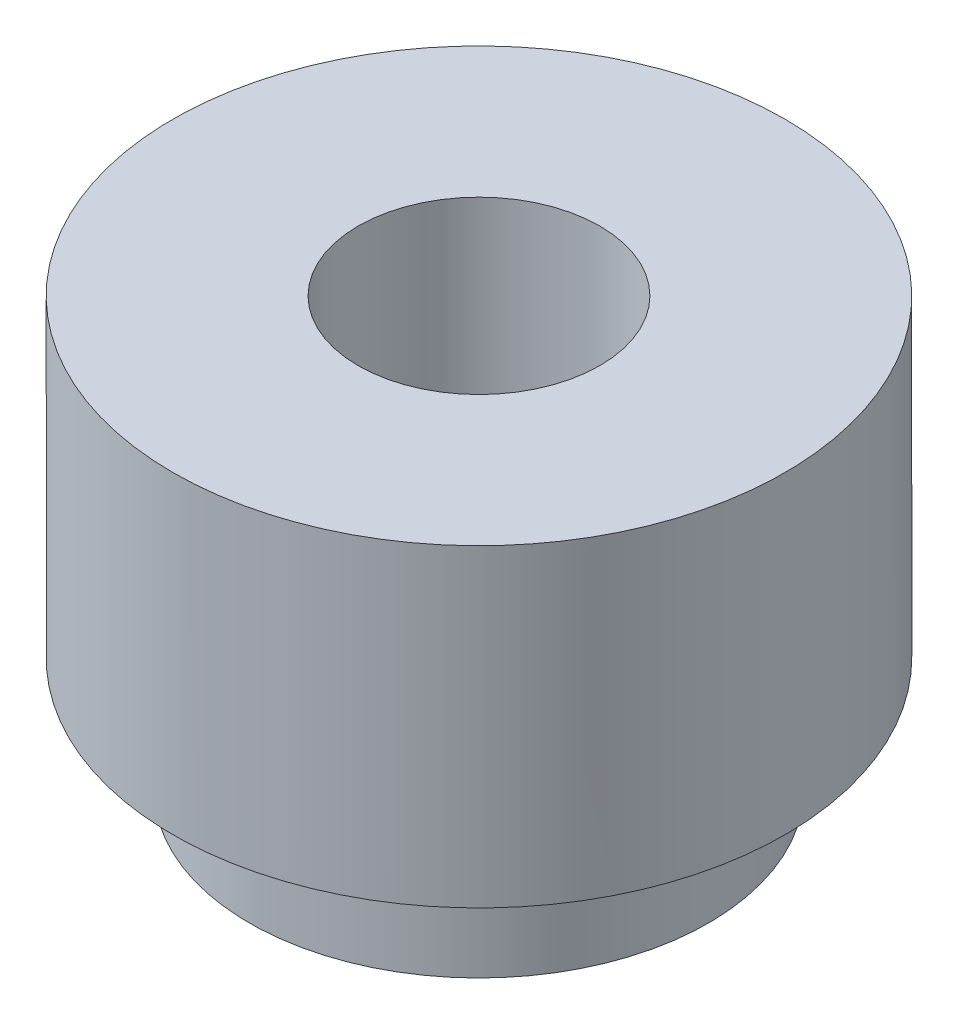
ISO-10303-21;
HEADER;
FILE_DESCRIPTION(('STEP AP214'),'2;1');
FILE_NAME('part.step','',(''),(''),'','','');
FILE_SCHEMA(('AUTOMOTIVE_DESIGN { 1 0 10303 214 1 1 1 1 }'));
ENDSEC;
DATA;
#1=APPLICATION_CONTEXT('core data for automotive mechanical design processes');
#2=APPLICATION_PROTOCOL_DEFINITION('international standard','automotive_design',2000,#1);
#3=PRODUCT_CONTEXT('',#1,'mechanical');
#4=PRODUCT('Part','Part','',(#3));
#5=PRODUCT_RELATED_PRODUCT_CATEGORY('part','',(#4));
#6=PRODUCT_DEFINITION_FORMATION('','',#4);
#7=PRODUCT_DEFINITION_CONTEXT('part definition',#1,'design');
#8=PRODUCT_DEFINITION('design','',#6,#7);
#9=PRODUCT_DEFINITION_SHAPE('','',#8);
#10=(LENGTH_UNIT() NAMED_UNIT(*) SI_UNIT(.MILLI.,.METRE.));
#11=(NAMED_UNIT(*) PLANE_ANGLE_UNIT() SI_UNIT($,.RADIAN.));
#12=(NAMED_UNIT(*) SI_UNIT($,.STERADIAN.) SOLID_ANGLE_UNIT());
#13=UNCERTAINTY_MEASURE_WITH_UNIT(LENGTH_MEASURE(1.E-05),#10,'distance_accuracy_value','');
#14=(GEOMETRIC_REPRESENTATION_CONTEXT(3) GLOBAL_UNCERTAINTY_ASSIGNED_CONTEXT((#13)) GLOBAL_UNIT_ASSIGNED_CONTEXT((#10,
#11,#12)) REPRESENTATION_CONTEXT('',''));
#15=CARTESIAN_POINT('',(0.,0.,0.));
#16=DIRECTION('',(0.,0.,1.));
#17=DIRECTION('',(1.,0.,0.));
#18=AXIS2_PLACEMENT_3D('',#15,#16,#17);
#19=CARTESIAN_POINT('',(0.,35.56,0.));
#20=DIRECTION('',(0.,1.,0.));
#21=DIRECTION('',(0.,0.,1.));
#22=AXIS2_PLACEMENT_3D('',#19,#20,#21);
#23=PLANE('',#22);
#24=CARTESIAN_POINT('',(0.,35.56,0.));
#25=DIRECTION('',(0.,1.,0.));
#26=DIRECTION('',(0.,0.,1.));
#27=AXIS2_PLACEMENT_3D('',#24,#25,#26);
#28=CIRCLE('',#27,25.4);
#29=CARTESIAN_POINT('',(0.,35.56,25.4));
#30=VERTEX_POINT('',#29);
#31=EDGE_CURVE('E10',#30,#30,#28,.T.);
#32=ORIENTED_EDGE('',*,*,#31,.T.);
#33=EDGE_LOOP('',(#32));
#34=FACE_BOUND('',#33,.T.);
#35=CARTESIAN_POINT('',(0.,35.56,0.));
#36=DIRECTION('',(0.,1.,0.));
#37=DIRECTION('',(0.,0.,1.));
#38=AXIS2_PLACEMENT_3D('',#35,#36,#37);
#39=CIRCLE('',#38,10.033);
#40=CARTESIAN_POINT('',(0.,35.56,10.033));
#41=VERTEX_POINT('',#40);
#42=EDGE_CURVE('E32',#41,#41,#39,.T.);
#43=ORIENTED_EDGE('',*,*,#42,.F.);
#44=EDGE_LOOP('',(#43));
#45=FACE_BOUND('',#44,.T.);
#46=ADVANCED_FACE('F25',(#34,#45),#23,.T.);
#47=CARTESIAN_POINT('',(0.,0.,0.));
#48=DIRECTION('',(0.,1.,0.));
#49=DIRECTION('',(0.,0.,1.));
#50=AXIS2_PLACEMENT_3D('',#47,#48,#49);
#51=PLANE('',#50);
#52=CARTESIAN_POINT('',(0.,0.,0.));
#53=DIRECTION('',(0.,-1.,0.));
#54=DIRECTION('',(0.,0.,-1.));
#55=AXIS2_PLACEMENT_3D('',#52,#53,#54);
#56=CIRCLE('',#55,19.05);
#57=CARTESIAN_POINT('',(0.,0.,-19.05));
#58=VERTEX_POINT('',#57);
#59=EDGE_CURVE('E48',#58,#58,#56,.T.);
#60=ORIENTED_EDGE('',*,*,#59,.T.);
#61=EDGE_LOOP('',(#60));
#62=FACE_BOUND('',#61,.T.);
#63=CARTESIAN_POINT('',(0.,0.,0.));
#64=DIRECTION('',(0.,1.,0.));
#65=DIRECTION('',(0.,0.,1.));
#66=AXIS2_PLACEMENT_3D('',#63,#64,#65);
#67=CIRCLE('',#66,10.033);
#68=CARTESIAN_POINT('',(0.,0.,10.033));
#69=VERTEX_POINT('',#68);
#70=EDGE_CURVE('E36',#69,#69,#67,.T.);
#71=ORIENTED_EDGE('',*,*,#70,.T.);
#72=EDGE_LOOP('',(#71));
#73=FACE_BOUND('',#72,.T.);
#74=ADVANCED_FACE('F52',(#62,#73),#51,.F.);
#75=CARTESIAN_POINT('',(0.,35.56,0.));
#76=DIRECTION('',(0.,-1.,0.));
#77=DIRECTION('',(0.,0.,-1.));
#78=AXIS2_PLACEMENT_3D('',#75,#76,#77);
#79=CYLINDRICAL_SURFACE('',#78,25.4);
#80=CARTESIAN_POINT('',(0.,9.525,0.));
#81=DIRECTION('',(0.,-1.,0.));
#82=DIRECTION('',(0.,0.,-1.));
#83=AXIS2_PLACEMENT_3D('',#80,#81,#82);
#84=CIRCLE('',#83,25.4);
#85=CARTESIAN_POINT('',(0.,9.525,-25.4));
#86=VERTEX_POINT('',#85);
#87=EDGE_CURVE('E40',#86,#86,#84,.T.);
#88=ORIENTED_EDGE('',*,*,#87,.F.);
#89=EDGE_LOOP('',(#88));
#90=FACE_BOUND('',#89,.T.);
#91=ORIENTED_EDGE('',*,*,#31,.F.);
#92=EDGE_LOOP('',(#91));
#93=FACE_BOUND('',#92,.T.);
#94=ADVANCED_FACE('F27',(#90,#93),#79,.T.);
#95=CARTESIAN_POINT('',(0.,35.56,0.));
#96=DIRECTION('',(0.,-1.,0.));
#97=DIRECTION('',(0.,0.,-1.));
#98=AXIS2_PLACEMENT_3D('',#95,#96,#97);
#99=CYLINDRICAL_SURFACE('',#98,10.033);
#100=ORIENTED_EDGE('',*,*,#42,.T.);
#101=EDGE_LOOP('',(#100));
#102=FACE_BOUND('',#101,.T.);
#103=ORIENTED_EDGE('',*,*,#70,.F.);
#104=EDGE_LOOP('',(#103));
#105=FACE_BOUND('',#104,.T.);
#106=ADVANCED_FACE('F64',(#102,#105),#99,.F.);
#107=CARTESIAN_POINT('',(25.4,9.525,0.));
#108=DIRECTION('',(0.,1.,0.));
#109=DIRECTION('',(0.,0.,1.));
#110=AXIS2_PLACEMENT_3D('',#107,#108,#109);
#111=PLANE('',#110);
#112=CARTESIAN_POINT('',(0.,9.525,0.));
#113=DIRECTION('',(0.,-1.,0.));
#114=DIRECTION('',(0.,0.,-1.));
#115=AXIS2_PLACEMENT_3D('',#112,#113,#114);
#116=CIRCLE('',#115,19.05);
#117=CARTESIAN_POINT('',(0.,9.525,-19.05));
#118=VERTEX_POINT('',#117);
#119=EDGE_CURVE('E45',#118,#118,#116,.T.);
#120=ORIENTED_EDGE('',*,*,#119,.F.);
#121=EDGE_LOOP('',(#120));
#122=FACE_BOUND('',#121,.T.);
#123=ORIENTED_EDGE('',*,*,#87,.T.);
#124=EDGE_LOOP('',(#123));
#125=FACE_BOUND('',#124,.T.);
#126=ADVANCED_FACE('F58',(#122,#125),#111,.F.);
#127=CARTESIAN_POINT('',(0.,0.,0.));
#128=DIRECTION('',(0.,-1.,0.));
#129=DIRECTION('',(0.,0.,-1.));
#130=AXIS2_PLACEMENT_3D('',#127,#128,#129);
#131=CYLINDRICAL_SURFACE('',#130,19.05);
#132=ORIENTED_EDGE('',*,*,#59,.F.);
#133=EDGE_LOOP('',(#132));
#134=FACE_BOUND('',#133,.T.);
#135=ORIENTED_EDGE('',*,*,#119,.T.);
#136=EDGE_LOOP('',(#135));
#137=FACE_BOUND('',#136,.T.);
#138=ADVANCED_FACE('F55',(#134,#137),#131,.T.);
#139=CLOSED_SHELL('',(#46,#74,#94,#106,#126,#138));
#140=MANIFOLD_SOLID_BREP('B2',#139);
#141=ADVANCED_BREP_SHAPE_REPRESENTATION('',(#18,#140),#14);
#142=SHAPE_DEFINITION_REPRESENTATION(#9,#141);
ENDSEC;
END-ISO-10303-21;
